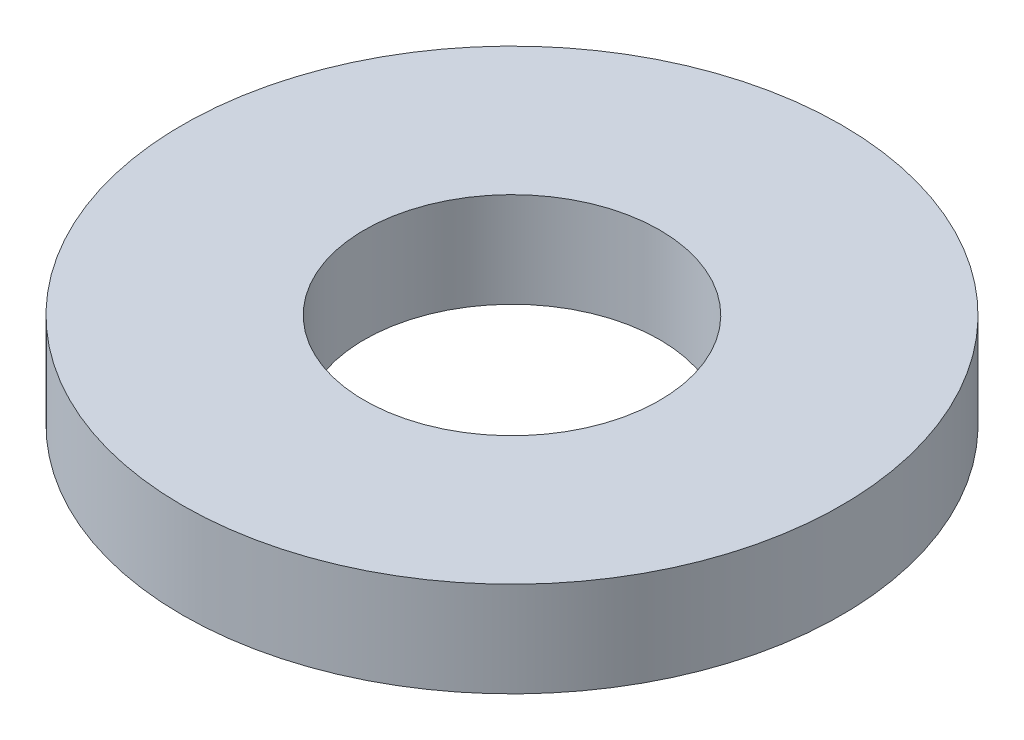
from build123d import *

# Parameters (mm, degrees)
SKETCH1_R          = 3.5433
EXTRUDE1_DEPTH     = 1.02108
SKETCH2_R          = 1.5875
CUT_EXTRUDE1_DEPTH = 6.113956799


with BuildPart() as part:
    # Sketch1 → Extrude1 (new body)
    with BuildSketch(Plane(origin=(0, 0, 0), x_dir=(1, 0, 0), z_dir=(0, 1, 0))):
        with Locations(Location((0, 0, 0), (0, 0, 90))):
            Circle(SKETCH1_R)
    extrude(amount=EXTRUDE1_DEPTH)

    # Sketch2 → Cut-Extrude1 (cut, through all)
    with BuildSketch(Plane.XZ):
        with Locations(Location((0, 0, 0), (0, 0, 270))):
            Circle(SKETCH2_R)
    extrude(amount=-CUT_EXTRUDE1_DEPTH, mode=Mode.SUBTRACT)


solid = part.part
